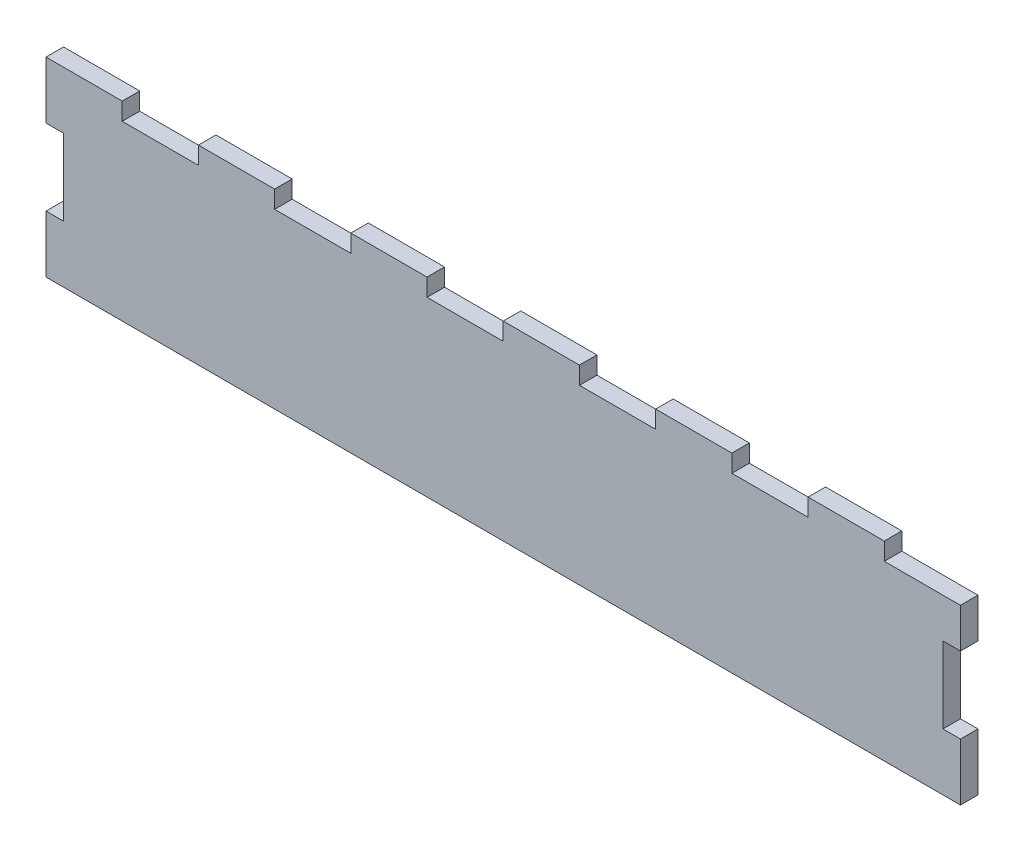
ISO-10303-21;
HEADER;
FILE_DESCRIPTION(('STEP AP214'),'2;1');
FILE_NAME('part.step','',(''),(''),'','','');
FILE_SCHEMA(('AUTOMOTIVE_DESIGN { 1 0 10303 214 1 1 1 1 }'));
ENDSEC;
DATA;
#1=APPLICATION_CONTEXT('core data for automotive mechanical design processes');
#2=APPLICATION_PROTOCOL_DEFINITION('international standard','automotive_design',2000,#1);
#3=PRODUCT_CONTEXT('',#1,'mechanical');
#4=PRODUCT('Part','Part','',(#3));
#5=PRODUCT_RELATED_PRODUCT_CATEGORY('part','',(#4));
#6=PRODUCT_DEFINITION_FORMATION('','',#4);
#7=PRODUCT_DEFINITION_CONTEXT('part definition',#1,'design');
#8=PRODUCT_DEFINITION('design','',#6,#7);
#9=PRODUCT_DEFINITION_SHAPE('','',#8);
#10=(LENGTH_UNIT() NAMED_UNIT(*) SI_UNIT(.MILLI.,.METRE.));
#11=(NAMED_UNIT(*) PLANE_ANGLE_UNIT() SI_UNIT($,.RADIAN.));
#12=(NAMED_UNIT(*) SI_UNIT($,.STERADIAN.) SOLID_ANGLE_UNIT());
#13=UNCERTAINTY_MEASURE_WITH_UNIT(LENGTH_MEASURE(1.E-05),#10,'distance_accuracy_value','');
#14=(GEOMETRIC_REPRESENTATION_CONTEXT(3) GLOBAL_UNCERTAINTY_ASSIGNED_CONTEXT((#13)) GLOBAL_UNIT_ASSIGNED_CONTEXT((#10,
#11,#12)) REPRESENTATION_CONTEXT('',''));
#15=CARTESIAN_POINT('',(0.,0.,0.));
#16=DIRECTION('',(0.,0.,1.));
#17=DIRECTION('',(1.,0.,0.));
#18=AXIS2_PLACEMENT_3D('',#15,#16,#17);
#19=CARTESIAN_POINT('',(0.,0.,5.842));
#20=DIRECTION('',(-1.,0.,0.));
#21=DIRECTION('',(0.,-1.,0.));
#22=AXIS2_PLACEMENT_3D('',#19,#20,#21);
#23=PLANE('',#22);
#24=DIRECTION('',(0.,1.,0.));
#25=VECTOR('',#24,1.);
#26=CARTESIAN_POINT('',(0.,0.,0.));
#27=LINE('',#26,#25);
#28=CARTESIAN_POINT('',(0.,0.,0.));
#29=VERTEX_POINT('',#28);
#30=CARTESIAN_POINT('',(-1.66533453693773E-13,19.0500000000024,0.));
#31=VERTEX_POINT('',#30);
#32=EDGE_CURVE('E285',#29,#31,#27,.T.);
#33=ORIENTED_EDGE('',*,*,#32,.T.);
#34=DIRECTION('',(0.,0.,-1.));
#35=VECTOR('',#34,1.);
#36=CARTESIAN_POINT('',(-1.66533453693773E-13,19.0500000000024,5.842));
#37=LINE('',#36,#35);
#38=CARTESIAN_POINT('',(-1.66533453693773E-13,19.0500000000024,5.842));
#39=VERTEX_POINT('',#38);
#40=EDGE_CURVE('E11',#39,#31,#37,.T.);
#41=ORIENTED_EDGE('',*,*,#40,.F.);
#42=DIRECTION('',(0.,1.,0.));
#43=VECTOR('',#42,1.);
#44=CARTESIAN_POINT('',(0.,0.,5.842));
#45=LINE('',#44,#43);
#46=CARTESIAN_POINT('',(0.,0.,5.842));
#47=VERTEX_POINT('',#46);
#48=EDGE_CURVE('E351',#47,#39,#45,.T.);
#49=ORIENTED_EDGE('',*,*,#48,.F.);
#50=DIRECTION('',(0.,0.,-1.));
#51=VECTOR('',#50,1.);
#52=CARTESIAN_POINT('',(0.,0.,5.842));
#53=LINE('',#52,#51);
#54=EDGE_CURVE('E281',#47,#29,#53,.T.);
#55=ORIENTED_EDGE('',*,*,#54,.T.);
#56=EDGE_LOOP('',(#33,#41,#49,#55));
#57=FACE_BOUND('',#56,.T.);
#58=ADVANCED_FACE('F33',(#57),#23,.F.);
#59=CARTESIAN_POINT('',(-5.84200000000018,19.0500000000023,5.842));
#60=DIRECTION('',(0.,-1.,0.));
#61=DIRECTION('',(1.,0.,0.));
#62=AXIS2_PLACEMENT_3D('',#59,#60,#61);
#63=PLANE('',#62);
#64=DIRECTION('',(-1.,0.,0.));
#65=VECTOR('',#64,1.);
#66=CARTESIAN_POINT('',(-5.84200000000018,19.0500000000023,0.));
#67=LINE('',#66,#65);
#68=CARTESIAN_POINT('',(-5.84200000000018,19.0500000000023,0.));
#69=VERTEX_POINT('',#68);
#70=EDGE_CURVE('E288',#31,#69,#67,.T.);
#71=ORIENTED_EDGE('',*,*,#70,.T.);
#72=DIRECTION('',(0.,0.,-1.));
#73=VECTOR('',#72,1.);
#74=CARTESIAN_POINT('',(-5.84200000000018,19.0500000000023,5.842));
#75=LINE('',#74,#73);
#76=CARTESIAN_POINT('',(-5.84200000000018,19.0500000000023,5.842));
#77=VERTEX_POINT('',#76);
#78=EDGE_CURVE('E41',#77,#69,#75,.T.);
#79=ORIENTED_EDGE('',*,*,#78,.F.);
#80=DIRECTION('',(-1.,0.,0.));
#81=VECTOR('',#80,1.);
#82=CARTESIAN_POINT('',(-5.84200000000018,19.0500000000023,5.842));
#83=LINE('',#82,#81);
#84=EDGE_CURVE('E170',#39,#77,#83,.T.);
#85=ORIENTED_EDGE('',*,*,#84,.F.);
#86=ORIENTED_EDGE('',*,*,#40,.T.);
#87=EDGE_LOOP('',(#71,#79,#85,#86));
#88=FACE_BOUND('',#87,.T.);
#89=ADVANCED_FACE('F539',(#88),#63,.F.);
#90=CARTESIAN_POINT('',(-5.84200000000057,44.4500000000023,5.842));
#91=DIRECTION('',(-1.,0.,0.));
#92=DIRECTION('',(0.,-1.,0.));
#93=AXIS2_PLACEMENT_3D('',#90,#91,#92);
#94=PLANE('',#93);
#95=DIRECTION('',(0.,1.,0.));
#96=VECTOR('',#95,1.);
#97=CARTESIAN_POINT('',(-5.84200000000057,44.4500000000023,0.));
#98=LINE('',#97,#96);
#99=CARTESIAN_POINT('',(-5.84200000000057,44.4500000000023,0.));
#100=VERTEX_POINT('',#99);
#101=EDGE_CURVE('E290',#69,#100,#98,.T.);
#102=ORIENTED_EDGE('',*,*,#101,.T.);
#103=DIRECTION('',(0.,0.,-1.));
#104=VECTOR('',#103,1.);
#105=CARTESIAN_POINT('',(-5.84200000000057,44.4500000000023,5.842));
#106=LINE('',#105,#104);
#107=CARTESIAN_POINT('',(-5.84200000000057,44.4500000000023,5.842));
#108=VERTEX_POINT('',#107);
#109=EDGE_CURVE('E436',#108,#100,#106,.T.);
#110=ORIENTED_EDGE('',*,*,#109,.F.);
#111=DIRECTION('',(0.,1.,0.));
#112=VECTOR('',#111,1.);
#113=CARTESIAN_POINT('',(-5.84200000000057,44.4500000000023,5.842));
#114=LINE('',#113,#112);
#115=EDGE_CURVE('E444',#77,#108,#114,.T.);
#116=ORIENTED_EDGE('',*,*,#115,.F.);
#117=ORIENTED_EDGE('',*,*,#78,.T.);
#118=EDGE_LOOP('',(#102,#110,#116,#117));
#119=FACE_BOUND('',#118,.T.);
#120=ADVANCED_FACE('F442',(#119),#94,.F.);
#121=CARTESIAN_POINT('',(-5.55111512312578E-13,44.4500000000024,5.842));
#122=DIRECTION('',(0.,1.,0.));
#123=DIRECTION('',(-1.,0.,0.));
#124=AXIS2_PLACEMENT_3D('',#121,#122,#123);
#125=PLANE('',#124);
#126=DIRECTION('',(1.,0.,0.));
#127=VECTOR('',#126,1.);
#128=CARTESIAN_POINT('',(-5.55111512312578E-13,44.4500000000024,0.));
#129=LINE('',#128,#127);
#130=CARTESIAN_POINT('',(-5.55111512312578E-13,44.4500000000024,0.));
#131=VERTEX_POINT('',#130);
#132=EDGE_CURVE('E292',#100,#131,#129,.T.);
#133=ORIENTED_EDGE('',*,*,#132,.T.);
#134=DIRECTION('',(0.,0.,-1.));
#135=VECTOR('',#134,1.);
#136=CARTESIAN_POINT('',(-5.55111512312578E-13,44.4500000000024,5.842));
#137=LINE('',#136,#135);
#138=CARTESIAN_POINT('',(-5.55111512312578E-13,44.4500000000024,5.842));
#139=VERTEX_POINT('',#138);
#140=EDGE_CURVE('E433',#139,#131,#137,.T.);
#141=ORIENTED_EDGE('',*,*,#140,.F.);
#142=DIRECTION('',(1.,0.,0.));
#143=VECTOR('',#142,1.);
#144=CARTESIAN_POINT('',(-5.55111512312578E-13,44.4500000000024,5.842));
#145=LINE('',#144,#143);
#146=EDGE_CURVE('E462',#108,#139,#145,.T.);
#147=ORIENTED_EDGE('',*,*,#146,.F.);
#148=ORIENTED_EDGE('',*,*,#109,.T.);
#149=EDGE_LOOP('',(#133,#141,#147,#148));
#150=FACE_BOUND('',#149,.T.);
#151=ADVANCED_FACE('F453',(#150),#125,.F.);
#152=CARTESIAN_POINT('',(-5.55111512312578E-13,44.4500000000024,5.842));
#153=DIRECTION('',(-1.,0.,0.));
#154=DIRECTION('',(0.,-1.,0.));
#155=AXIS2_PLACEMENT_3D('',#152,#153,#154);
#156=PLANE('',#155);
#157=DIRECTION('',(0.,1.,0.));
#158=VECTOR('',#157,1.);
#159=CARTESIAN_POINT('',(-5.55111512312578E-13,44.4500000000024,0.));
#160=LINE('',#159,#158);
#161=CARTESIAN_POINT('',(0.,57.658,0.));
#162=VERTEX_POINT('',#161);
#163=EDGE_CURVE('E294',#131,#162,#160,.T.);
#164=ORIENTED_EDGE('',*,*,#163,.T.);
#165=DIRECTION('',(0.,0.,-1.));
#166=VECTOR('',#165,1.);
#167=CARTESIAN_POINT('',(0.,57.658,5.842));
#168=LINE('',#167,#166);
#169=CARTESIAN_POINT('',(0.,57.658,5.842));
#170=VERTEX_POINT('',#169);
#171=EDGE_CURVE('E430',#170,#162,#168,.T.);
#172=ORIENTED_EDGE('',*,*,#171,.F.);
#173=DIRECTION('',(0.,1.,0.));
#174=VECTOR('',#173,1.);
#175=CARTESIAN_POINT('',(-5.55111512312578E-13,44.4500000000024,5.842));
#176=LINE('',#175,#174);
#177=EDGE_CURVE('E459',#139,#170,#176,.T.);
#178=ORIENTED_EDGE('',*,*,#177,.F.);
#179=ORIENTED_EDGE('',*,*,#140,.T.);
#180=EDGE_LOOP('',(#164,#172,#178,#179));
#181=FACE_BOUND('',#180,.T.);
#182=ADVANCED_FACE('F457',(#181),#156,.F.);
#183=CARTESIAN_POINT('',(-25.4,57.658,5.842));
#184=DIRECTION('',(0.,-1.,0.));
#185=DIRECTION('',(0.,0.,-1.));
#186=AXIS2_PLACEMENT_3D('',#183,#184,#185);
#187=PLANE('',#186);
#188=DIRECTION('',(-1.,0.,0.));
#189=VECTOR('',#188,1.);
#190=CARTESIAN_POINT('',(-25.4,57.658,0.));
#191=LINE('',#190,#189);
#192=CARTESIAN_POINT('',(-25.4,57.658,0.));
#193=VERTEX_POINT('',#192);
#194=EDGE_CURVE('E296',#162,#193,#191,.T.);
#195=ORIENTED_EDGE('',*,*,#194,.T.);
#196=DIRECTION('',(0.,0.,-1.));
#197=VECTOR('',#196,1.);
#198=CARTESIAN_POINT('',(-25.4,57.658,5.842));
#199=LINE('',#198,#197);
#200=CARTESIAN_POINT('',(-25.4,57.658,5.842));
#201=VERTEX_POINT('',#200);
#202=EDGE_CURVE('E427',#201,#193,#199,.T.);
#203=ORIENTED_EDGE('',*,*,#202,.F.);
#204=DIRECTION('',(-1.,0.,0.));
#205=VECTOR('',#204,1.);
#206=CARTESIAN_POINT('',(-25.4,57.658,5.842));
#207=LINE('',#206,#205);
#208=EDGE_CURVE('E461',#170,#201,#207,.T.);
#209=ORIENTED_EDGE('',*,*,#208,.F.);
#210=ORIENTED_EDGE('',*,*,#171,.T.);
#211=EDGE_LOOP('',(#195,#203,#209,#210));
#212=FACE_BOUND('',#211,.T.);
#213=ADVANCED_FACE('F552',(#212),#187,.F.);
#214=CARTESIAN_POINT('',(-25.4,63.5,5.842));
#215=DIRECTION('',(-1.,0.,0.));
#216=DIRECTION('',(0.,0.,1.));
#217=AXIS2_PLACEMENT_3D('',#214,#215,#216);
#218=PLANE('',#217);
#219=DIRECTION('',(0.,1.,0.));
#220=VECTOR('',#219,1.);
#221=CARTESIAN_POINT('',(-25.4,63.5,0.));
#222=LINE('',#221,#220);
#223=CARTESIAN_POINT('',(-25.4,63.5,0.));
#224=VERTEX_POINT('',#223);
#225=EDGE_CURVE('E298',#193,#224,#222,.T.);
#226=ORIENTED_EDGE('',*,*,#225,.T.);
#227=DIRECTION('',(0.,0.,-1.));
#228=VECTOR('',#227,1.);
#229=CARTESIAN_POINT('',(-25.4,63.5,5.842));
#230=LINE('',#229,#228);
#231=CARTESIAN_POINT('',(-25.4,63.5,5.842));
#232=VERTEX_POINT('',#231);
#233=EDGE_CURVE('E424',#232,#224,#230,.T.);
#234=ORIENTED_EDGE('',*,*,#233,.F.);
#235=DIRECTION('',(0.,1.,0.));
#236=VECTOR('',#235,1.);
#237=CARTESIAN_POINT('',(-25.4,63.5,5.842));
#238=LINE('',#237,#236);
#239=EDGE_CURVE('E464',#201,#232,#238,.T.);
#240=ORIENTED_EDGE('',*,*,#239,.F.);
#241=ORIENTED_EDGE('',*,*,#202,.T.);
#242=EDGE_LOOP('',(#226,#234,#240,#241));
#243=FACE_BOUND('',#242,.T.);
#244=ADVANCED_FACE('F555',(#243),#218,.F.);
#245=CARTESIAN_POINT('',(-25.4,63.5,5.842));
#246=DIRECTION('',(0.,-1.,0.));
#247=DIRECTION('',(0.,0.,-1.));
#248=AXIS2_PLACEMENT_3D('',#245,#246,#247);
#249=PLANE('',#248);
#250=DIRECTION('',(-1.,0.,0.));
#251=VECTOR('',#250,1.);
#252=CARTESIAN_POINT('',(-25.4,63.5,0.));
#253=LINE('',#252,#251);
#254=CARTESIAN_POINT('',(-50.8000000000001,63.5,0.));
#255=VERTEX_POINT('',#254);
#256=EDGE_CURVE('E300',#224,#255,#253,.T.);
#257=ORIENTED_EDGE('',*,*,#256,.T.);
#258=DIRECTION('',(0.,0.,-1.));
#259=VECTOR('',#258,1.);
#260=CARTESIAN_POINT('',(-50.8000000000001,63.5,5.842));
#261=LINE('',#260,#259);
#262=CARTESIAN_POINT('',(-50.8000000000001,63.5,5.842));
#263=VERTEX_POINT('',#262);
#264=EDGE_CURVE('E421',#263,#255,#261,.T.);
#265=ORIENTED_EDGE('',*,*,#264,.F.);
#266=DIRECTION('',(-1.,0.,0.));
#267=VECTOR('',#266,1.);
#268=CARTESIAN_POINT('',(-25.4,63.5,5.842));
#269=LINE('',#268,#267);
#270=EDGE_CURVE('E470',#232,#263,#269,.T.);
#271=ORIENTED_EDGE('',*,*,#270,.F.);
#272=ORIENTED_EDGE('',*,*,#233,.T.);
#273=EDGE_LOOP('',(#257,#265,#271,#272));
#274=FACE_BOUND('',#273,.T.);
#275=ADVANCED_FACE('F559',(#274),#249,.F.);
#276=CARTESIAN_POINT('',(-50.8000000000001,57.658,5.842));
#277=DIRECTION('',(1.,0.,0.));
#278=DIRECTION('',(0.,0.,-1.));
#279=AXIS2_PLACEMENT_3D('',#276,#277,#278);
#280=PLANE('',#279);
#281=DIRECTION('',(0.,-1.,0.));
#282=VECTOR('',#281,1.);
#283=CARTESIAN_POINT('',(-50.8000000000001,57.658,0.));
#284=LINE('',#283,#282);
#285=CARTESIAN_POINT('',(-50.8000000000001,57.658,0.));
#286=VERTEX_POINT('',#285);
#287=EDGE_CURVE('E302',#255,#286,#284,.T.);
#288=ORIENTED_EDGE('',*,*,#287,.T.);
#289=DIRECTION('',(0.,0.,-1.));
#290=VECTOR('',#289,1.);
#291=CARTESIAN_POINT('',(-50.8000000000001,57.658,5.842));
#292=LINE('',#291,#290);
#293=CARTESIAN_POINT('',(-50.8000000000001,57.658,5.842));
#294=VERTEX_POINT('',#293);
#295=EDGE_CURVE('E418',#294,#286,#292,.T.);
#296=ORIENTED_EDGE('',*,*,#295,.F.);
#297=DIRECTION('',(0.,-1.,0.));
#298=VECTOR('',#297,1.);
#299=CARTESIAN_POINT('',(-50.8000000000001,57.658,5.842));
#300=LINE('',#299,#298);
#301=EDGE_CURVE('E472',#263,#294,#300,.T.);
#302=ORIENTED_EDGE('',*,*,#301,.F.);
#303=ORIENTED_EDGE('',*,*,#264,.T.);
#304=EDGE_LOOP('',(#288,#296,#302,#303));
#305=FACE_BOUND('',#304,.T.);
#306=ADVANCED_FACE('F563',(#305),#280,.F.);
#307=CARTESIAN_POINT('',(-76.2,57.658,5.842));
#308=DIRECTION('',(0.,-1.,0.));
#309=DIRECTION('',(0.,0.,-1.));
#310=AXIS2_PLACEMENT_3D('',#307,#308,#309);
#311=PLANE('',#310);
#312=DIRECTION('',(-1.,0.,0.));
#313=VECTOR('',#312,1.);
#314=CARTESIAN_POINT('',(-76.2,57.658,0.));
#315=LINE('',#314,#313);
#316=CARTESIAN_POINT('',(-76.2,57.658,0.));
#317=VERTEX_POINT('',#316);
#318=EDGE_CURVE('E304',#286,#317,#315,.T.);
#319=ORIENTED_EDGE('',*,*,#318,.T.);
#320=DIRECTION('',(0.,0.,-1.));
#321=VECTOR('',#320,1.);
#322=CARTESIAN_POINT('',(-76.2,57.658,5.842));
#323=LINE('',#322,#321);
#324=CARTESIAN_POINT('',(-76.2,57.658,5.842));
#325=VERTEX_POINT('',#324);
#326=EDGE_CURVE('E415',#325,#317,#323,.T.);
#327=ORIENTED_EDGE('',*,*,#326,.F.);
#328=DIRECTION('',(-1.,0.,0.));
#329=VECTOR('',#328,1.);
#330=CARTESIAN_POINT('',(-76.2,57.658,5.842));
#331=LINE('',#330,#329);
#332=EDGE_CURVE('E474',#294,#325,#331,.T.);
#333=ORIENTED_EDGE('',*,*,#332,.F.);
#334=ORIENTED_EDGE('',*,*,#295,.T.);
#335=EDGE_LOOP('',(#319,#327,#333,#334));
#336=FACE_BOUND('',#335,.T.);
#337=ADVANCED_FACE('F567',(#336),#311,.F.);
#338=CARTESIAN_POINT('',(-76.2,63.5,5.842));
#339=DIRECTION('',(-1.,0.,0.));
#340=DIRECTION('',(0.,0.,1.));
#341=AXIS2_PLACEMENT_3D('',#338,#339,#340);
#342=PLANE('',#341);
#343=DIRECTION('',(0.,1.,0.));
#344=VECTOR('',#343,1.);
#345=CARTESIAN_POINT('',(-76.2,63.5,0.));
#346=LINE('',#345,#344);
#347=CARTESIAN_POINT('',(-76.2,63.5,0.));
#348=VERTEX_POINT('',#347);
#349=EDGE_CURVE('E306',#317,#348,#346,.T.);
#350=ORIENTED_EDGE('',*,*,#349,.T.);
#351=DIRECTION('',(0.,0.,-1.));
#352=VECTOR('',#351,1.);
#353=CARTESIAN_POINT('',(-76.2,63.5,5.842));
#354=LINE('',#353,#352);
#355=CARTESIAN_POINT('',(-76.2,63.5,5.842));
#356=VERTEX_POINT('',#355);
#357=EDGE_CURVE('E412',#356,#348,#354,.T.);
#358=ORIENTED_EDGE('',*,*,#357,.F.);
#359=DIRECTION('',(0.,1.,0.));
#360=VECTOR('',#359,1.);
#361=CARTESIAN_POINT('',(-76.2,63.5,5.842));
#362=LINE('',#361,#360);
#363=EDGE_CURVE('E476',#325,#356,#362,.T.);
#364=ORIENTED_EDGE('',*,*,#363,.F.);
#365=ORIENTED_EDGE('',*,*,#326,.T.);
#366=EDGE_LOOP('',(#350,#358,#364,#365));
#367=FACE_BOUND('',#366,.T.);
#368=ADVANCED_FACE('F571',(#367),#342,.F.);
#369=CARTESIAN_POINT('',(-76.2,63.5,5.842));
#370=DIRECTION('',(0.,-1.,0.));
#371=DIRECTION('',(0.,0.,-1.));
#372=AXIS2_PLACEMENT_3D('',#369,#370,#371);
#373=PLANE('',#372);
#374=DIRECTION('',(-1.,0.,0.));
#375=VECTOR('',#374,1.);
#376=CARTESIAN_POINT('',(-76.2,63.5,0.));
#377=LINE('',#376,#375);
#378=CARTESIAN_POINT('',(-101.6,63.5,0.));
#379=VERTEX_POINT('',#378);
#380=EDGE_CURVE('E308',#348,#379,#377,.T.);
#381=ORIENTED_EDGE('',*,*,#380,.T.);
#382=DIRECTION('',(0.,0.,-1.));
#383=VECTOR('',#382,1.);
#384=CARTESIAN_POINT('',(-101.6,63.5,5.842));
#385=LINE('',#384,#383);
#386=CARTESIAN_POINT('',(-101.6,63.5,5.842));
#387=VERTEX_POINT('',#386);
#388=EDGE_CURVE('E409',#387,#379,#385,.T.);
#389=ORIENTED_EDGE('',*,*,#388,.F.);
#390=DIRECTION('',(-1.,0.,0.));
#391=VECTOR('',#390,1.);
#392=CARTESIAN_POINT('',(-76.2,63.5,5.842));
#393=LINE('',#392,#391);
#394=EDGE_CURVE('E478',#356,#387,#393,.T.);
#395=ORIENTED_EDGE('',*,*,#394,.F.);
#396=ORIENTED_EDGE('',*,*,#357,.T.);
#397=EDGE_LOOP('',(#381,#389,#395,#396));
#398=FACE_BOUND('',#397,.T.);
#399=ADVANCED_FACE('F575',(#398),#373,.F.);
#400=CARTESIAN_POINT('',(-101.6,57.658,5.842));
#401=DIRECTION('',(1.,0.,0.));
#402=DIRECTION('',(0.,0.,-1.));
#403=AXIS2_PLACEMENT_3D('',#400,#401,#402);
#404=PLANE('',#403);
#405=DIRECTION('',(0.,-1.,0.));
#406=VECTOR('',#405,1.);
#407=CARTESIAN_POINT('',(-101.6,57.658,0.));
#408=LINE('',#407,#406);
#409=CARTESIAN_POINT('',(-101.6,57.658,0.));
#410=VERTEX_POINT('',#409);
#411=EDGE_CURVE('E310',#379,#410,#408,.T.);
#412=ORIENTED_EDGE('',*,*,#411,.T.);
#413=DIRECTION('',(0.,0.,-1.));
#414=VECTOR('',#413,1.);
#415=CARTESIAN_POINT('',(-101.6,57.658,5.842));
#416=LINE('',#415,#414);
#417=CARTESIAN_POINT('',(-101.6,57.658,5.842));
#418=VERTEX_POINT('',#417);
#419=EDGE_CURVE('E406',#418,#410,#416,.T.);
#420=ORIENTED_EDGE('',*,*,#419,.F.);
#421=DIRECTION('',(0.,-1.,0.));
#422=VECTOR('',#421,1.);
#423=CARTESIAN_POINT('',(-101.6,57.658,5.842));
#424=LINE('',#423,#422);
#425=EDGE_CURVE('E480',#387,#418,#424,.T.);
#426=ORIENTED_EDGE('',*,*,#425,.F.);
#427=ORIENTED_EDGE('',*,*,#388,.T.);
#428=EDGE_LOOP('',(#412,#420,#426,#427));
#429=FACE_BOUND('',#428,.T.);
#430=ADVANCED_FACE('F579',(#429),#404,.F.);
#431=CARTESIAN_POINT('',(-127.,57.658,5.842));
#432=DIRECTION('',(0.,-1.,0.));
#433=DIRECTION('',(0.,0.,-1.));
#434=AXIS2_PLACEMENT_3D('',#431,#432,#433);
#435=PLANE('',#434);
#436=DIRECTION('',(-1.,0.,0.));
#437=VECTOR('',#436,1.);
#438=CARTESIAN_POINT('',(-127.,57.658,0.));
#439=LINE('',#438,#437);
#440=CARTESIAN_POINT('',(-127.,57.658,0.));
#441=VERTEX_POINT('',#440);
#442=EDGE_CURVE('E312',#410,#441,#439,.T.);
#443=ORIENTED_EDGE('',*,*,#442,.T.);
#444=DIRECTION('',(0.,0.,-1.));
#445=VECTOR('',#444,1.);
#446=CARTESIAN_POINT('',(-127.,57.658,5.842));
#447=LINE('',#446,#445);
#448=CARTESIAN_POINT('',(-127.,57.658,5.842));
#449=VERTEX_POINT('',#448);
#450=EDGE_CURVE('E403',#449,#441,#447,.T.);
#451=ORIENTED_EDGE('',*,*,#450,.F.);
#452=DIRECTION('',(-1.,0.,0.));
#453=VECTOR('',#452,1.);
#454=CARTESIAN_POINT('',(-127.,57.658,5.842));
#455=LINE('',#454,#453);
#456=EDGE_CURVE('E482',#418,#449,#455,.T.);
#457=ORIENTED_EDGE('',*,*,#456,.F.);
#458=ORIENTED_EDGE('',*,*,#419,.T.);
#459=EDGE_LOOP('',(#443,#451,#457,#458));
#460=FACE_BOUND('',#459,.T.);
#461=ADVANCED_FACE('F583',(#460),#435,.F.);
#462=CARTESIAN_POINT('',(-127.,63.5,5.842));
#463=DIRECTION('',(-1.,0.,0.));
#464=DIRECTION('',(0.,0.,1.));
#465=AXIS2_PLACEMENT_3D('',#462,#463,#464);
#466=PLANE('',#465);
#467=DIRECTION('',(0.,1.,0.));
#468=VECTOR('',#467,1.);
#469=CARTESIAN_POINT('',(-127.,63.5,0.));
#470=LINE('',#469,#468);
#471=CARTESIAN_POINT('',(-127.,63.5,0.));
#472=VERTEX_POINT('',#471);
#473=EDGE_CURVE('E314',#441,#472,#470,.T.);
#474=ORIENTED_EDGE('',*,*,#473,.T.);
#475=DIRECTION('',(0.,0.,-1.));
#476=VECTOR('',#475,1.);
#477=CARTESIAN_POINT('',(-127.,63.5,5.842));
#478=LINE('',#477,#476);
#479=CARTESIAN_POINT('',(-127.,63.5,5.842));
#480=VERTEX_POINT('',#479);
#481=EDGE_CURVE('E400',#480,#472,#478,.T.);
#482=ORIENTED_EDGE('',*,*,#481,.F.);
#483=DIRECTION('',(0.,1.,0.));
#484=VECTOR('',#483,1.);
#485=CARTESIAN_POINT('',(-127.,63.5,5.842));
#486=LINE('',#485,#484);
#487=EDGE_CURVE('E484',#449,#480,#486,.T.);
#488=ORIENTED_EDGE('',*,*,#487,.F.);
#489=ORIENTED_EDGE('',*,*,#450,.T.);
#490=EDGE_LOOP('',(#474,#482,#488,#489));
#491=FACE_BOUND('',#490,.T.);
#492=ADVANCED_FACE('F587',(#491),#466,.F.);
#493=CARTESIAN_POINT('',(-127.,63.5,5.842));
#494=DIRECTION('',(0.,-1.,0.));
#495=DIRECTION('',(0.,0.,-1.));
#496=AXIS2_PLACEMENT_3D('',#493,#494,#495);
#497=PLANE('',#496);
#498=DIRECTION('',(-1.,0.,0.));
#499=VECTOR('',#498,1.);
#500=CARTESIAN_POINT('',(-127.,63.5,0.));
#501=LINE('',#500,#499);
#502=CARTESIAN_POINT('',(-152.4,63.5,0.));
#503=VERTEX_POINT('',#502);
#504=EDGE_CURVE('E316',#472,#503,#501,.T.);
#505=ORIENTED_EDGE('',*,*,#504,.T.);
#506=DIRECTION('',(0.,0.,-1.));
#507=VECTOR('',#506,1.);
#508=CARTESIAN_POINT('',(-152.4,63.5,5.842));
#509=LINE('',#508,#507);
#510=CARTESIAN_POINT('',(-152.4,63.5,5.842));
#511=VERTEX_POINT('',#510);
#512=EDGE_CURVE('E397',#511,#503,#509,.T.);
#513=ORIENTED_EDGE('',*,*,#512,.F.);
#514=DIRECTION('',(-1.,0.,0.));
#515=VECTOR('',#514,1.);
#516=CARTESIAN_POINT('',(-127.,63.5,5.842));
#517=LINE('',#516,#515);
#518=EDGE_CURVE('E486',#480,#511,#517,.T.);
#519=ORIENTED_EDGE('',*,*,#518,.F.);
#520=ORIENTED_EDGE('',*,*,#481,.T.);
#521=EDGE_LOOP('',(#505,#513,#519,#520));
#522=FACE_BOUND('',#521,.T.);
#523=ADVANCED_FACE('F591',(#522),#497,.F.);
#524=CARTESIAN_POINT('',(-152.4,57.658,5.842));
#525=DIRECTION('',(1.,0.,0.));
#526=DIRECTION('',(0.,0.,-1.));
#527=AXIS2_PLACEMENT_3D('',#524,#525,#526);
#528=PLANE('',#527);
#529=DIRECTION('',(0.,-1.,0.));
#530=VECTOR('',#529,1.);
#531=CARTESIAN_POINT('',(-152.4,57.658,0.));
#532=LINE('',#531,#530);
#533=CARTESIAN_POINT('',(-152.4,57.658,0.));
#534=VERTEX_POINT('',#533);
#535=EDGE_CURVE('E318',#503,#534,#532,.T.);
#536=ORIENTED_EDGE('',*,*,#535,.T.);
#537=DIRECTION('',(0.,0.,-1.));
#538=VECTOR('',#537,1.);
#539=CARTESIAN_POINT('',(-152.4,57.658,5.842));
#540=LINE('',#539,#538);
#541=CARTESIAN_POINT('',(-152.4,57.658,5.842));
#542=VERTEX_POINT('',#541);
#543=EDGE_CURVE('E394',#542,#534,#540,.T.);
#544=ORIENTED_EDGE('',*,*,#543,.F.);
#545=DIRECTION('',(0.,-1.,0.));
#546=VECTOR('',#545,1.);
#547=CARTESIAN_POINT('',(-152.4,57.658,5.842));
#548=LINE('',#547,#546);
#549=EDGE_CURVE('E488',#511,#542,#548,.T.);
#550=ORIENTED_EDGE('',*,*,#549,.F.);
#551=ORIENTED_EDGE('',*,*,#512,.T.);
#552=EDGE_LOOP('',(#536,#544,#550,#551));
#553=FACE_BOUND('',#552,.T.);
#554=ADVANCED_FACE('F595',(#553),#528,.F.);
#555=CARTESIAN_POINT('',(-177.8,57.658,5.842));
#556=DIRECTION('',(0.,-1.,0.));
#557=DIRECTION('',(0.,0.,-1.));
#558=AXIS2_PLACEMENT_3D('',#555,#556,#557);
#559=PLANE('',#558);
#560=DIRECTION('',(-1.,0.,0.));
#561=VECTOR('',#560,1.);
#562=CARTESIAN_POINT('',(-177.8,57.658,0.));
#563=LINE('',#562,#561);
#564=CARTESIAN_POINT('',(-177.8,57.658,0.));
#565=VERTEX_POINT('',#564);
#566=EDGE_CURVE('E320',#534,#565,#563,.T.);
#567=ORIENTED_EDGE('',*,*,#566,.T.);
#568=DIRECTION('',(0.,0.,-1.));
#569=VECTOR('',#568,1.);
#570=CARTESIAN_POINT('',(-177.8,57.658,5.842));
#571=LINE('',#570,#569);
#572=CARTESIAN_POINT('',(-177.8,57.658,5.842));
#573=VERTEX_POINT('',#572);
#574=EDGE_CURVE('E391',#573,#565,#571,.T.);
#575=ORIENTED_EDGE('',*,*,#574,.F.);
#576=DIRECTION('',(-1.,0.,0.));
#577=VECTOR('',#576,1.);
#578=CARTESIAN_POINT('',(-177.8,57.658,5.842));
#579=LINE('',#578,#577);
#580=EDGE_CURVE('E490',#542,#573,#579,.T.);
#581=ORIENTED_EDGE('',*,*,#580,.F.);
#582=ORIENTED_EDGE('',*,*,#543,.T.);
#583=EDGE_LOOP('',(#567,#575,#581,#582));
#584=FACE_BOUND('',#583,.T.);
#585=ADVANCED_FACE('F599',(#584),#559,.F.);
#586=CARTESIAN_POINT('',(-177.8,63.5,5.842));
#587=DIRECTION('',(-1.,0.,0.));
#588=DIRECTION('',(0.,0.,1.));
#589=AXIS2_PLACEMENT_3D('',#586,#587,#588);
#590=PLANE('',#589);
#591=DIRECTION('',(0.,1.,0.));
#592=VECTOR('',#591,1.);
#593=CARTESIAN_POINT('',(-177.8,63.5,0.));
#594=LINE('',#593,#592);
#595=CARTESIAN_POINT('',(-177.8,63.5,0.));
#596=VERTEX_POINT('',#595);
#597=EDGE_CURVE('E322',#565,#596,#594,.T.);
#598=ORIENTED_EDGE('',*,*,#597,.T.);
#599=DIRECTION('',(0.,0.,-1.));
#600=VECTOR('',#599,1.);
#601=CARTESIAN_POINT('',(-177.8,63.5,5.842));
#602=LINE('',#601,#600);
#603=CARTESIAN_POINT('',(-177.8,63.5,5.842));
#604=VERTEX_POINT('',#603);
#605=EDGE_CURVE('E388',#604,#596,#602,.T.);
#606=ORIENTED_EDGE('',*,*,#605,.F.);
#607=DIRECTION('',(0.,1.,0.));
#608=VECTOR('',#607,1.);
#609=CARTESIAN_POINT('',(-177.8,63.5,5.842));
#610=LINE('',#609,#608);
#611=EDGE_CURVE('E492',#573,#604,#610,.T.);
#612=ORIENTED_EDGE('',*,*,#611,.F.);
#613=ORIENTED_EDGE('',*,*,#574,.T.);
#614=EDGE_LOOP('',(#598,#606,#612,#613));
#615=FACE_BOUND('',#614,.T.);
#616=ADVANCED_FACE('F603',(#615),#590,.F.);
#617=CARTESIAN_POINT('',(-177.8,63.5,5.842));
#618=DIRECTION('',(0.,-1.,0.));
#619=DIRECTION('',(0.,0.,-1.));
#620=AXIS2_PLACEMENT_3D('',#617,#618,#619);
#621=PLANE('',#620);
#622=DIRECTION('',(-1.,0.,0.));
#623=VECTOR('',#622,1.);
#624=CARTESIAN_POINT('',(-177.8,63.5,0.));
#625=LINE('',#624,#623);
#626=CARTESIAN_POINT('',(-203.2,63.5,0.));
#627=VERTEX_POINT('',#626);
#628=EDGE_CURVE('E324',#596,#627,#625,.T.);
#629=ORIENTED_EDGE('',*,*,#628,.T.);
#630=DIRECTION('',(0.,0.,-1.));
#631=VECTOR('',#630,1.);
#632=CARTESIAN_POINT('',(-203.2,63.5,5.842));
#633=LINE('',#632,#631);
#634=CARTESIAN_POINT('',(-203.2,63.5,5.842));
#635=VERTEX_POINT('',#634);
#636=EDGE_CURVE('E385',#635,#627,#633,.T.);
#637=ORIENTED_EDGE('',*,*,#636,.F.);
#638=DIRECTION('',(-1.,0.,0.));
#639=VECTOR('',#638,1.);
#640=CARTESIAN_POINT('',(-177.8,63.5,5.842));
#641=LINE('',#640,#639);
#642=EDGE_CURVE('E494',#604,#635,#641,.T.);
#643=ORIENTED_EDGE('',*,*,#642,.F.);
#644=ORIENTED_EDGE('',*,*,#605,.T.);
#645=EDGE_LOOP('',(#629,#637,#643,#644));
#646=FACE_BOUND('',#645,.T.);
#647=ADVANCED_FACE('F607',(#646),#621,.F.);
#648=CARTESIAN_POINT('',(-203.2,57.658,5.842));
#649=DIRECTION('',(1.,0.,0.));
#650=DIRECTION('',(0.,0.,-1.));
#651=AXIS2_PLACEMENT_3D('',#648,#649,#650);
#652=PLANE('',#651);
#653=DIRECTION('',(0.,-1.,0.));
#654=VECTOR('',#653,1.);
#655=CARTESIAN_POINT('',(-203.2,57.658,0.));
#656=LINE('',#655,#654);
#657=CARTESIAN_POINT('',(-203.2,57.658,0.));
#658=VERTEX_POINT('',#657);
#659=EDGE_CURVE('E326',#627,#658,#656,.T.);
#660=ORIENTED_EDGE('',*,*,#659,.T.);
#661=DIRECTION('',(0.,0.,-1.));
#662=VECTOR('',#661,1.);
#663=CARTESIAN_POINT('',(-203.2,57.658,5.842));
#664=LINE('',#663,#662);
#665=CARTESIAN_POINT('',(-203.2,57.658,5.842));
#666=VERTEX_POINT('',#665);
#667=EDGE_CURVE('E382',#666,#658,#664,.T.);
#668=ORIENTED_EDGE('',*,*,#667,.F.);
#669=DIRECTION('',(0.,-1.,0.));
#670=VECTOR('',#669,1.);
#671=CARTESIAN_POINT('',(-203.2,57.658,5.842));
#672=LINE('',#671,#670);
#673=EDGE_CURVE('E496',#635,#666,#672,.T.);
#674=ORIENTED_EDGE('',*,*,#673,.F.);
#675=ORIENTED_EDGE('',*,*,#636,.T.);
#676=EDGE_LOOP('',(#660,#668,#674,#675));
#677=FACE_BOUND('',#676,.T.);
#678=ADVANCED_FACE('F611',(#677),#652,.F.);
#679=CARTESIAN_POINT('',(-228.6,57.658,5.842));
#680=DIRECTION('',(0.,-1.,0.));
#681=DIRECTION('',(0.,0.,-1.));
#682=AXIS2_PLACEMENT_3D('',#679,#680,#681);
#683=PLANE('',#682);
#684=DIRECTION('',(-1.,0.,0.));
#685=VECTOR('',#684,1.);
#686=CARTESIAN_POINT('',(-228.6,57.658,0.));
#687=LINE('',#686,#685);
#688=CARTESIAN_POINT('',(-228.6,57.658,0.));
#689=VERTEX_POINT('',#688);
#690=EDGE_CURVE('E328',#658,#689,#687,.T.);
#691=ORIENTED_EDGE('',*,*,#690,.T.);
#692=DIRECTION('',(0.,0.,-1.));
#693=VECTOR('',#692,1.);
#694=CARTESIAN_POINT('',(-228.6,57.658,5.842));
#695=LINE('',#694,#693);
#696=CARTESIAN_POINT('',(-228.6,57.658,5.842));
#697=VERTEX_POINT('',#696);
#698=EDGE_CURVE('E379',#697,#689,#695,.T.);
#699=ORIENTED_EDGE('',*,*,#698,.F.);
#700=DIRECTION('',(-1.,0.,0.));
#701=VECTOR('',#700,1.);
#702=CARTESIAN_POINT('',(-228.6,57.658,5.842));
#703=LINE('',#702,#701);
#704=EDGE_CURVE('E498',#666,#697,#703,.T.);
#705=ORIENTED_EDGE('',*,*,#704,.F.);
#706=ORIENTED_EDGE('',*,*,#667,.T.);
#707=EDGE_LOOP('',(#691,#699,#705,#706));
#708=FACE_BOUND('',#707,.T.);
#709=ADVANCED_FACE('F615',(#708),#683,.F.);
#710=CARTESIAN_POINT('',(-228.6,63.5,5.842));
#711=DIRECTION('',(-1.,0.,0.));
#712=DIRECTION('',(0.,0.,1.));
#713=AXIS2_PLACEMENT_3D('',#710,#711,#712);
#714=PLANE('',#713);
#715=DIRECTION('',(0.,1.,0.));
#716=VECTOR('',#715,1.);
#717=CARTESIAN_POINT('',(-228.6,63.5,0.));
#718=LINE('',#717,#716);
#719=CARTESIAN_POINT('',(-228.6,63.5,0.));
#720=VERTEX_POINT('',#719);
#721=EDGE_CURVE('E330',#689,#720,#718,.T.);
#722=ORIENTED_EDGE('',*,*,#721,.T.);
#723=DIRECTION('',(0.,0.,-1.));
#724=VECTOR('',#723,1.);
#725=CARTESIAN_POINT('',(-228.6,63.5,5.842));
#726=LINE('',#725,#724);
#727=CARTESIAN_POINT('',(-228.6,63.5,5.842));
#728=VERTEX_POINT('',#727);
#729=EDGE_CURVE('E376',#728,#720,#726,.T.);
#730=ORIENTED_EDGE('',*,*,#729,.F.);
#731=DIRECTION('',(0.,1.,0.));
#732=VECTOR('',#731,1.);
#733=CARTESIAN_POINT('',(-228.6,63.5,5.842));
#734=LINE('',#733,#732);
#735=EDGE_CURVE('E500',#697,#728,#734,.T.);
#736=ORIENTED_EDGE('',*,*,#735,.F.);
#737=ORIENTED_EDGE('',*,*,#698,.T.);
#738=EDGE_LOOP('',(#722,#730,#736,#737));
#739=FACE_BOUND('',#738,.T.);
#740=ADVANCED_FACE('F619',(#739),#714,.F.);
#741=CARTESIAN_POINT('',(-228.6,63.5,5.842));
#742=DIRECTION('',(0.,-1.,0.));
#743=DIRECTION('',(0.,0.,-1.));
#744=AXIS2_PLACEMENT_3D('',#741,#742,#743);
#745=PLANE('',#744);
#746=DIRECTION('',(-1.,0.,0.));
#747=VECTOR('',#746,1.);
#748=CARTESIAN_POINT('',(-228.6,63.5,0.));
#749=LINE('',#748,#747);
#750=CARTESIAN_POINT('',(-254.,63.5,0.));
#751=VERTEX_POINT('',#750);
#752=EDGE_CURVE('E332',#720,#751,#749,.T.);
#753=ORIENTED_EDGE('',*,*,#752,.T.);
#754=DIRECTION('',(0.,0.,-1.));
#755=VECTOR('',#754,1.);
#756=CARTESIAN_POINT('',(-254.,63.5,5.842));
#757=LINE('',#756,#755);
#758=CARTESIAN_POINT('',(-254.,63.5,5.842));
#759=VERTEX_POINT('',#758);
#760=EDGE_CURVE('E373',#759,#751,#757,.T.);
#761=ORIENTED_EDGE('',*,*,#760,.F.);
#762=DIRECTION('',(-1.,0.,0.));
#763=VECTOR('',#762,1.);
#764=CARTESIAN_POINT('',(-228.6,63.5,5.842));
#765=LINE('',#764,#763);
#766=EDGE_CURVE('E502',#728,#759,#765,.T.);
#767=ORIENTED_EDGE('',*,*,#766,.F.);
#768=ORIENTED_EDGE('',*,*,#729,.T.);
#769=EDGE_LOOP('',(#753,#761,#767,#768));
#770=FACE_BOUND('',#769,.T.);
#771=ADVANCED_FACE('F623',(#770),#745,.F.);
#772=CARTESIAN_POINT('',(-254.,57.658,5.842));
#773=DIRECTION('',(1.,0.,0.));
#774=DIRECTION('',(0.,0.,-1.));
#775=AXIS2_PLACEMENT_3D('',#772,#773,#774);
#776=PLANE('',#775);
#777=DIRECTION('',(0.,-1.,0.));
#778=VECTOR('',#777,1.);
#779=CARTESIAN_POINT('',(-254.,57.658,0.));
#780=LINE('',#779,#778);
#781=CARTESIAN_POINT('',(-254.,57.658,0.));
#782=VERTEX_POINT('',#781);
#783=EDGE_CURVE('E334',#751,#782,#780,.T.);
#784=ORIENTED_EDGE('',*,*,#783,.T.);
#785=DIRECTION('',(0.,0.,-1.));
#786=VECTOR('',#785,1.);
#787=CARTESIAN_POINT('',(-254.,57.658,5.842));
#788=LINE('',#787,#786);
#789=CARTESIAN_POINT('',(-254.,57.658,5.842));
#790=VERTEX_POINT('',#789);
#791=EDGE_CURVE('E370',#790,#782,#788,.T.);
#792=ORIENTED_EDGE('',*,*,#791,.F.);
#793=DIRECTION('',(0.,-1.,0.));
#794=VECTOR('',#793,1.);
#795=CARTESIAN_POINT('',(-254.,57.658,5.842));
#796=LINE('',#795,#794);
#797=EDGE_CURVE('E504',#759,#790,#796,.T.);
#798=ORIENTED_EDGE('',*,*,#797,.F.);
#799=ORIENTED_EDGE('',*,*,#760,.T.);
#800=EDGE_LOOP('',(#784,#792,#798,#799));
#801=FACE_BOUND('',#800,.T.);
#802=ADVANCED_FACE('F627',(#801),#776,.F.);
#803=CARTESIAN_POINT('',(-279.4,57.658,5.842));
#804=DIRECTION('',(0.,-1.,0.));
#805=DIRECTION('',(0.,0.,-1.));
#806=AXIS2_PLACEMENT_3D('',#803,#804,#805);
#807=PLANE('',#806);
#808=DIRECTION('',(-1.,0.,0.));
#809=VECTOR('',#808,1.);
#810=CARTESIAN_POINT('',(-279.4,57.658,0.));
#811=LINE('',#810,#809);
#812=CARTESIAN_POINT('',(-279.4,57.658,0.));
#813=VERTEX_POINT('',#812);
#814=EDGE_CURVE('E336',#782,#813,#811,.T.);
#815=ORIENTED_EDGE('',*,*,#814,.T.);
#816=DIRECTION('',(0.,0.,-1.));
#817=VECTOR('',#816,1.);
#818=CARTESIAN_POINT('',(-279.4,57.658,5.842));
#819=LINE('',#818,#817);
#820=CARTESIAN_POINT('',(-279.4,57.658,5.842));
#821=VERTEX_POINT('',#820);
#822=EDGE_CURVE('E367',#821,#813,#819,.T.);
#823=ORIENTED_EDGE('',*,*,#822,.F.);
#824=DIRECTION('',(-1.,0.,0.));
#825=VECTOR('',#824,1.);
#826=CARTESIAN_POINT('',(-279.4,57.658,5.842));
#827=LINE('',#826,#825);
#828=EDGE_CURVE('E506',#790,#821,#827,.T.);
#829=ORIENTED_EDGE('',*,*,#828,.F.);
#830=ORIENTED_EDGE('',*,*,#791,.T.);
#831=EDGE_LOOP('',(#815,#823,#829,#830));
#832=FACE_BOUND('',#831,.T.);
#833=ADVANCED_FACE('F631',(#832),#807,.F.);
#834=CARTESIAN_POINT('',(-279.4,63.5,5.842));
#835=DIRECTION('',(-1.,0.,0.));
#836=DIRECTION('',(0.,0.,1.));
#837=AXIS2_PLACEMENT_3D('',#834,#835,#836);
#838=PLANE('',#837);
#839=DIRECTION('',(0.,1.,0.));
#840=VECTOR('',#839,1.);
#841=CARTESIAN_POINT('',(-279.4,63.5,0.));
#842=LINE('',#841,#840);
#843=CARTESIAN_POINT('',(-279.4,63.5,0.));
#844=VERTEX_POINT('',#843);
#845=EDGE_CURVE('E338',#813,#844,#842,.T.);
#846=ORIENTED_EDGE('',*,*,#845,.T.);
#847=DIRECTION('',(0.,0.,-1.));
#848=VECTOR('',#847,1.);
#849=CARTESIAN_POINT('',(-279.4,63.5,5.842));
#850=LINE('',#849,#848);
#851=CARTESIAN_POINT('',(-279.4,63.5,5.842));
#852=VERTEX_POINT('',#851);
#853=EDGE_CURVE('E364',#852,#844,#850,.T.);
#854=ORIENTED_EDGE('',*,*,#853,.F.);
#855=DIRECTION('',(0.,1.,0.));
#856=VECTOR('',#855,1.);
#857=CARTESIAN_POINT('',(-279.4,63.5,5.842));
#858=LINE('',#857,#856);
#859=EDGE_CURVE('E508',#821,#852,#858,.T.);
#860=ORIENTED_EDGE('',*,*,#859,.F.);
#861=ORIENTED_EDGE('',*,*,#822,.T.);
#862=EDGE_LOOP('',(#846,#854,#860,#861));
#863=FACE_BOUND('',#862,.T.);
#864=ADVANCED_FACE('F635',(#863),#838,.F.);
#865=CARTESIAN_POINT('',(-279.4,63.5,5.842));
#866=DIRECTION('',(0.,-1.,0.));
#867=DIRECTION('',(1.,0.,0.));
#868=AXIS2_PLACEMENT_3D('',#865,#866,#867);
#869=PLANE('',#868);
#870=DIRECTION('',(-1.,0.,0.));
#871=VECTOR('',#870,1.);
#872=CARTESIAN_POINT('',(-279.4,63.5,0.));
#873=LINE('',#872,#871);
#874=CARTESIAN_POINT('',(-304.8,63.5,0.));
#875=VERTEX_POINT('',#874);
#876=EDGE_CURVE('E340',#844,#875,#873,.T.);
#877=ORIENTED_EDGE('',*,*,#876,.T.);
#878=DIRECTION('',(0.,0.,-1.));
#879=VECTOR('',#878,1.);
#880=CARTESIAN_POINT('',(-304.8,63.5,5.842));
#881=LINE('',#880,#879);
#882=CARTESIAN_POINT('',(-304.8,63.5,5.842));
#883=VERTEX_POINT('',#882);
#884=EDGE_CURVE('E361',#883,#875,#881,.T.);
#885=ORIENTED_EDGE('',*,*,#884,.F.);
#886=DIRECTION('',(-1.,0.,0.));
#887=VECTOR('',#886,1.);
#888=CARTESIAN_POINT('',(-279.4,63.5,5.842));
#889=LINE('',#888,#887);
#890=EDGE_CURVE('E510',#852,#883,#889,.T.);
#891=ORIENTED_EDGE('',*,*,#890,.F.);
#892=ORIENTED_EDGE('',*,*,#853,.T.);
#893=EDGE_LOOP('',(#877,#885,#891,#892));
#894=FACE_BOUND('',#893,.T.);
#895=ADVANCED_FACE('F639',(#894),#869,.F.);
#896=CARTESIAN_POINT('',(-304.8,44.45,5.842));
#897=DIRECTION('',(1.,0.,0.));
#898=DIRECTION('',(0.,0.,-1.));
#899=AXIS2_PLACEMENT_3D('',#896,#897,#898);
#900=PLANE('',#899);
#901=DIRECTION('',(0.,-1.,0.));
#902=VECTOR('',#901,1.);
#903=CARTESIAN_POINT('',(-304.8,44.45,0.));
#904=LINE('',#903,#902);
#905=CARTESIAN_POINT('',(-304.8,44.45,0.));
#906=VERTEX_POINT('',#905);
#907=EDGE_CURVE('E342',#875,#906,#904,.T.);
#908=ORIENTED_EDGE('',*,*,#907,.T.);
#909=DIRECTION('',(0.,0.,-1.));
#910=VECTOR('',#909,1.);
#911=CARTESIAN_POINT('',(-304.8,44.45,5.842));
#912=LINE('',#911,#910);
#913=CARTESIAN_POINT('',(-304.8,44.45,5.842));
#914=VERTEX_POINT('',#913);
#915=EDGE_CURVE('E358',#914,#906,#912,.T.);
#916=ORIENTED_EDGE('',*,*,#915,.F.);
#917=DIRECTION('',(0.,-1.,0.));
#918=VECTOR('',#917,1.);
#919=CARTESIAN_POINT('',(-304.8,44.45,5.842));
#920=LINE('',#919,#918);
#921=EDGE_CURVE('E512',#883,#914,#920,.T.);
#922=ORIENTED_EDGE('',*,*,#921,.F.);
#923=ORIENTED_EDGE('',*,*,#884,.T.);
#924=EDGE_LOOP('',(#908,#916,#922,#923));
#925=FACE_BOUND('',#924,.T.);
#926=ADVANCED_FACE('F643',(#925),#900,.F.);
#927=CARTESIAN_POINT('',(-304.8,44.45,5.842));
#928=DIRECTION('',(0.,1.,0.));
#929=DIRECTION('',(0.,0.,1.));
#930=AXIS2_PLACEMENT_3D('',#927,#928,#929);
#931=PLANE('',#930);
#932=DIRECTION('',(1.,0.,0.));
#933=VECTOR('',#932,1.);
#934=CARTESIAN_POINT('',(-304.8,44.45,0.));
#935=LINE('',#934,#933);
#936=CARTESIAN_POINT('',(-298.958,44.45,0.));
#937=VERTEX_POINT('',#936);
#938=EDGE_CURVE('E344',#906,#937,#935,.T.);
#939=ORIENTED_EDGE('',*,*,#938,.T.);
#940=DIRECTION('',(0.,0.,-1.));
#941=VECTOR('',#940,1.);
#942=CARTESIAN_POINT('',(-298.958,44.45,5.842));
#943=LINE('',#942,#941);
#944=CARTESIAN_POINT('',(-298.958,44.45,5.842));
#945=VERTEX_POINT('',#944);
#946=EDGE_CURVE('E355',#945,#937,#943,.T.);
#947=ORIENTED_EDGE('',*,*,#946,.F.);
#948=DIRECTION('',(1.,0.,0.));
#949=VECTOR('',#948,1.);
#950=CARTESIAN_POINT('',(-304.8,44.45,5.842));
#951=LINE('',#950,#949);
#952=EDGE_CURVE('E514',#914,#945,#951,.T.);
#953=ORIENTED_EDGE('',*,*,#952,.F.);
#954=ORIENTED_EDGE('',*,*,#915,.T.);
#955=EDGE_LOOP('',(#939,#947,#953,#954));
#956=FACE_BOUND('',#955,.T.);
#957=ADVANCED_FACE('F520',(#956),#931,.F.);
#958=CARTESIAN_POINT('',(-298.958,44.45,5.842));
#959=DIRECTION('',(1.,0.,0.));
#960=DIRECTION('',(0.,0.,-1.));
#961=AXIS2_PLACEMENT_3D('',#958,#959,#960);
#962=PLANE('',#961);
#963=DIRECTION('',(0.,-1.,0.));
#964=VECTOR('',#963,1.);
#965=CARTESIAN_POINT('',(-298.958,44.45,0.));
#966=LINE('',#965,#964);
#967=CARTESIAN_POINT('',(-298.958,19.05,0.));
#968=VERTEX_POINT('',#967);
#969=EDGE_CURVE('E346',#937,#968,#966,.T.);
#970=ORIENTED_EDGE('',*,*,#969,.T.);
#971=DIRECTION('',(0.,0.,-1.));
#972=VECTOR('',#971,1.);
#973=CARTESIAN_POINT('',(-298.958,19.05,5.842));
#974=LINE('',#973,#972);
#975=CARTESIAN_POINT('',(-298.958,19.05,5.842));
#976=VERTEX_POINT('',#975);
#977=EDGE_CURVE('E276',#976,#968,#974,.T.);
#978=ORIENTED_EDGE('',*,*,#977,.F.);
#979=DIRECTION('',(0.,-1.,0.));
#980=VECTOR('',#979,1.);
#981=CARTESIAN_POINT('',(-298.958,44.45,5.842));
#982=LINE('',#981,#980);
#983=EDGE_CURVE('E267',#945,#976,#982,.T.);
#984=ORIENTED_EDGE('',*,*,#983,.F.);
#985=ORIENTED_EDGE('',*,*,#946,.T.);
#986=EDGE_LOOP('',(#970,#978,#984,#985));
#987=FACE_BOUND('',#986,.T.);
#988=ADVANCED_FACE('F524',(#987),#962,.F.);
#989=CARTESIAN_POINT('',(-298.958,19.05,5.842));
#990=DIRECTION('',(0.,-1.,0.));
#991=DIRECTION('',(0.,0.,-1.));
#992=AXIS2_PLACEMENT_3D('',#989,#990,#991);
#993=PLANE('',#992);
#994=DIRECTION('',(-1.,0.,0.));
#995=VECTOR('',#994,1.);
#996=CARTESIAN_POINT('',(-298.958,19.05,0.));
#997=LINE('',#996,#995);
#998=CARTESIAN_POINT('',(-304.8,19.05,0.));
#999=VERTEX_POINT('',#998);
#1000=EDGE_CURVE('E275',#968,#999,#997,.T.);
#1001=ORIENTED_EDGE('',*,*,#1000,.T.);
#1002=DIRECTION('',(0.,0.,-1.));
#1003=VECTOR('',#1002,1.);
#1004=CARTESIAN_POINT('',(-304.8,19.05,5.842));
#1005=LINE('',#1004,#1003);
#1006=CARTESIAN_POINT('',(-304.8,19.05,5.842));
#1007=VERTEX_POINT('',#1006);
#1008=EDGE_CURVE('E272',#1007,#999,#1005,.T.);
#1009=ORIENTED_EDGE('',*,*,#1008,.F.);
#1010=DIRECTION('',(-1.,0.,0.));
#1011=VECTOR('',#1010,1.);
#1012=CARTESIAN_POINT('',(-298.958,19.05,5.842));
#1013=LINE('',#1012,#1011);
#1014=EDGE_CURVE('E261',#976,#1007,#1013,.T.);
#1015=ORIENTED_EDGE('',*,*,#1014,.F.);
#1016=ORIENTED_EDGE('',*,*,#977,.T.);
#1017=EDGE_LOOP('',(#1001,#1009,#1015,#1016));
#1018=FACE_BOUND('',#1017,.T.);
#1019=ADVANCED_FACE('F273',(#1018),#993,.F.);
#1020=CARTESIAN_POINT('',(-304.8,0.,5.842));
#1021=DIRECTION('',(1.,0.,0.));
#1022=DIRECTION('',(0.,0.,-1.));
#1023=AXIS2_PLACEMENT_3D('',#1020,#1021,#1022);
#1024=PLANE('',#1023);
#1025=DIRECTION('',(0.,-1.,0.));
#1026=VECTOR('',#1025,1.);
#1027=CARTESIAN_POINT('',(-304.8,0.,0.));
#1028=LINE('',#1027,#1026);
#1029=CARTESIAN_POINT('',(-304.8,0.,0.));
#1030=VERTEX_POINT('',#1029);
#1031=EDGE_CURVE('E156',#999,#1030,#1028,.T.);
#1032=ORIENTED_EDGE('',*,*,#1031,.T.);
#1033=DIRECTION('',(0.,0.,-1.));
#1034=VECTOR('',#1033,1.);
#1035=CARTESIAN_POINT('',(-304.8,0.,5.842));
#1036=LINE('',#1035,#1034);
#1037=CARTESIAN_POINT('',(-304.8,0.,5.842));
#1038=VERTEX_POINT('',#1037);
#1039=EDGE_CURVE('E277',#1038,#1030,#1036,.T.);
#1040=ORIENTED_EDGE('',*,*,#1039,.F.);
#1041=DIRECTION('',(0.,-1.,0.));
#1042=VECTOR('',#1041,1.);
#1043=CARTESIAN_POINT('',(-304.8,0.,5.842));
#1044=LINE('',#1043,#1042);
#1045=EDGE_CURVE('E265',#1007,#1038,#1044,.T.);
#1046=ORIENTED_EDGE('',*,*,#1045,.F.);
#1047=ORIENTED_EDGE('',*,*,#1008,.T.);
#1048=EDGE_LOOP('',(#1032,#1040,#1046,#1047));
#1049=FACE_BOUND('',#1048,.T.);
#1050=ADVANCED_FACE('F279',(#1049),#1024,.F.);
#1051=CARTESIAN_POINT('',(0.,0.,5.842));
#1052=DIRECTION('',(0.,1.,0.));
#1053=DIRECTION('',(-1.,0.,0.));
#1054=AXIS2_PLACEMENT_3D('',#1051,#1052,#1053);
#1055=PLANE('',#1054);
#1056=DIRECTION('',(1.,0.,0.));
#1057=VECTOR('',#1056,1.);
#1058=CARTESIAN_POINT('',(0.,0.,0.));
#1059=LINE('',#1058,#1057);
#1060=EDGE_CURVE('E162',#1030,#29,#1059,.T.);
#1061=ORIENTED_EDGE('',*,*,#1060,.T.);
#1062=ORIENTED_EDGE('',*,*,#54,.F.);
#1063=DIRECTION('',(1.,0.,0.));
#1064=VECTOR('',#1063,1.);
#1065=CARTESIAN_POINT('',(0.,0.,5.842));
#1066=LINE('',#1065,#1064);
#1067=EDGE_CURVE('E49',#1038,#47,#1066,.T.);
#1068=ORIENTED_EDGE('',*,*,#1067,.F.);
#1069=ORIENTED_EDGE('',*,*,#1039,.T.);
#1070=EDGE_LOOP('',(#1061,#1062,#1068,#1069));
#1071=FACE_BOUND('',#1070,.T.);
#1072=ADVANCED_FACE('F528',(#1071),#1055,.F.);
#1073=CARTESIAN_POINT('',(0.,0.,5.842));
#1074=DIRECTION('',(0.,0.,-1.));
#1075=DIRECTION('',(-1.,0.,0.));
#1076=AXIS2_PLACEMENT_3D('',#1073,#1074,#1075);
#1077=PLANE('',#1076);
#1078=ORIENTED_EDGE('',*,*,#48,.T.);
#1079=ORIENTED_EDGE('',*,*,#84,.T.);
#1080=ORIENTED_EDGE('',*,*,#115,.T.);
#1081=ORIENTED_EDGE('',*,*,#146,.T.);
#1082=ORIENTED_EDGE('',*,*,#177,.T.);
#1083=ORIENTED_EDGE('',*,*,#208,.T.);
#1084=ORIENTED_EDGE('',*,*,#239,.T.);
#1085=ORIENTED_EDGE('',*,*,#270,.T.);
#1086=ORIENTED_EDGE('',*,*,#301,.T.);
#1087=ORIENTED_EDGE('',*,*,#332,.T.);
#1088=ORIENTED_EDGE('',*,*,#363,.T.);
#1089=ORIENTED_EDGE('',*,*,#394,.T.);
#1090=ORIENTED_EDGE('',*,*,#425,.T.);
#1091=ORIENTED_EDGE('',*,*,#456,.T.);
#1092=ORIENTED_EDGE('',*,*,#487,.T.);
#1093=ORIENTED_EDGE('',*,*,#518,.T.);
#1094=ORIENTED_EDGE('',*,*,#549,.T.);
#1095=ORIENTED_EDGE('',*,*,#580,.T.);
#1096=ORIENTED_EDGE('',*,*,#611,.T.);
#1097=ORIENTED_EDGE('',*,*,#642,.T.);
#1098=ORIENTED_EDGE('',*,*,#673,.T.);
#1099=ORIENTED_EDGE('',*,*,#704,.T.);
#1100=ORIENTED_EDGE('',*,*,#735,.T.);
#1101=ORIENTED_EDGE('',*,*,#766,.T.);
#1102=ORIENTED_EDGE('',*,*,#797,.T.);
#1103=ORIENTED_EDGE('',*,*,#828,.T.);
#1104=ORIENTED_EDGE('',*,*,#859,.T.);
#1105=ORIENTED_EDGE('',*,*,#890,.T.);
#1106=ORIENTED_EDGE('',*,*,#921,.T.);
#1107=ORIENTED_EDGE('',*,*,#952,.T.);
#1108=ORIENTED_EDGE('',*,*,#983,.T.);
#1109=ORIENTED_EDGE('',*,*,#1014,.T.);
#1110=ORIENTED_EDGE('',*,*,#1045,.T.);
#1111=ORIENTED_EDGE('',*,*,#1067,.T.);
#1112=EDGE_LOOP('',(#1078,#1079,#1080,#1081,#1082,#1083,#1084,#1085,#1086,#1087,#1088,#1089,
#1090,#1091,#1092,#1093,#1094,#1095,#1096,#1097,#1098,#1099,#1100,#1101,#1102,#1103,#1104,#1105,
#1106,#1107,#1108,#1109,#1110,#1111));
#1113=FACE_BOUND('',#1112,.T.);
#1114=ADVANCED_FACE('F263',(#1113),#1077,.F.);
#1115=CARTESIAN_POINT('',(0.,0.,0.));
#1116=DIRECTION('',(0.,0.,-1.));
#1117=DIRECTION('',(-1.,0.,0.));
#1118=AXIS2_PLACEMENT_3D('',#1115,#1116,#1117);
#1119=PLANE('',#1118);
#1120=ORIENTED_EDGE('',*,*,#32,.F.);
#1121=ORIENTED_EDGE('',*,*,#1060,.F.);
#1122=ORIENTED_EDGE('',*,*,#1031,.F.);
#1123=ORIENTED_EDGE('',*,*,#1000,.F.);
#1124=ORIENTED_EDGE('',*,*,#969,.F.);
#1125=ORIENTED_EDGE('',*,*,#938,.F.);
#1126=ORIENTED_EDGE('',*,*,#907,.F.);
#1127=ORIENTED_EDGE('',*,*,#876,.F.);
#1128=ORIENTED_EDGE('',*,*,#845,.F.);
#1129=ORIENTED_EDGE('',*,*,#814,.F.);
#1130=ORIENTED_EDGE('',*,*,#783,.F.);
#1131=ORIENTED_EDGE('',*,*,#752,.F.);
#1132=ORIENTED_EDGE('',*,*,#721,.F.);
#1133=ORIENTED_EDGE('',*,*,#690,.F.);
#1134=ORIENTED_EDGE('',*,*,#659,.F.);
#1135=ORIENTED_EDGE('',*,*,#628,.F.);
#1136=ORIENTED_EDGE('',*,*,#597,.F.);
#1137=ORIENTED_EDGE('',*,*,#566,.F.);
#1138=ORIENTED_EDGE('',*,*,#535,.F.);
#1139=ORIENTED_EDGE('',*,*,#504,.F.);
#1140=ORIENTED_EDGE('',*,*,#473,.F.);
#1141=ORIENTED_EDGE('',*,*,#442,.F.);
#1142=ORIENTED_EDGE('',*,*,#411,.F.);
#1143=ORIENTED_EDGE('',*,*,#380,.F.);
#1144=ORIENTED_EDGE('',*,*,#349,.F.);
#1145=ORIENTED_EDGE('',*,*,#318,.F.);
#1146=ORIENTED_EDGE('',*,*,#287,.F.);
#1147=ORIENTED_EDGE('',*,*,#256,.F.);
#1148=ORIENTED_EDGE('',*,*,#225,.F.);
#1149=ORIENTED_EDGE('',*,*,#194,.F.);
#1150=ORIENTED_EDGE('',*,*,#163,.F.);
#1151=ORIENTED_EDGE('',*,*,#132,.F.);
#1152=ORIENTED_EDGE('',*,*,#101,.F.);
#1153=ORIENTED_EDGE('',*,*,#70,.F.);
#1154=EDGE_LOOP('',(#1120,#1121,#1122,#1123,#1124,#1125,#1126,#1127,#1128,#1129,#1130,#1131,
#1132,#1133,#1134,#1135,#1136,#1137,#1138,#1139,#1140,#1141,#1142,#1143,#1144,#1145,#1146,#1147,
#1148,#1149,#1150,#1151,#1152,#1153));
#1155=FACE_BOUND('',#1154,.T.);
#1156=ADVANCED_FACE('F448',(#1155),#1119,.T.);
#1157=CLOSED_SHELL('',(#58,#89,#120,#151,#182,#213,#244,#275,#306,#337,#368,#399,#430,#461,#492,
#523,#554,#585,#616,#647,#678,#709,#740,#771,#802,#833,#864,#895,#926,#957,#988,#1019,#1050,
#1072,#1114,#1156));
#1158=MANIFOLD_SOLID_BREP('B2',#1157);
#1159=ADVANCED_BREP_SHAPE_REPRESENTATION('',(#18,#1158),#14);
#1160=SHAPE_DEFINITION_REPRESENTATION(#9,#1159);
ENDSEC;
END-ISO-10303-21;
